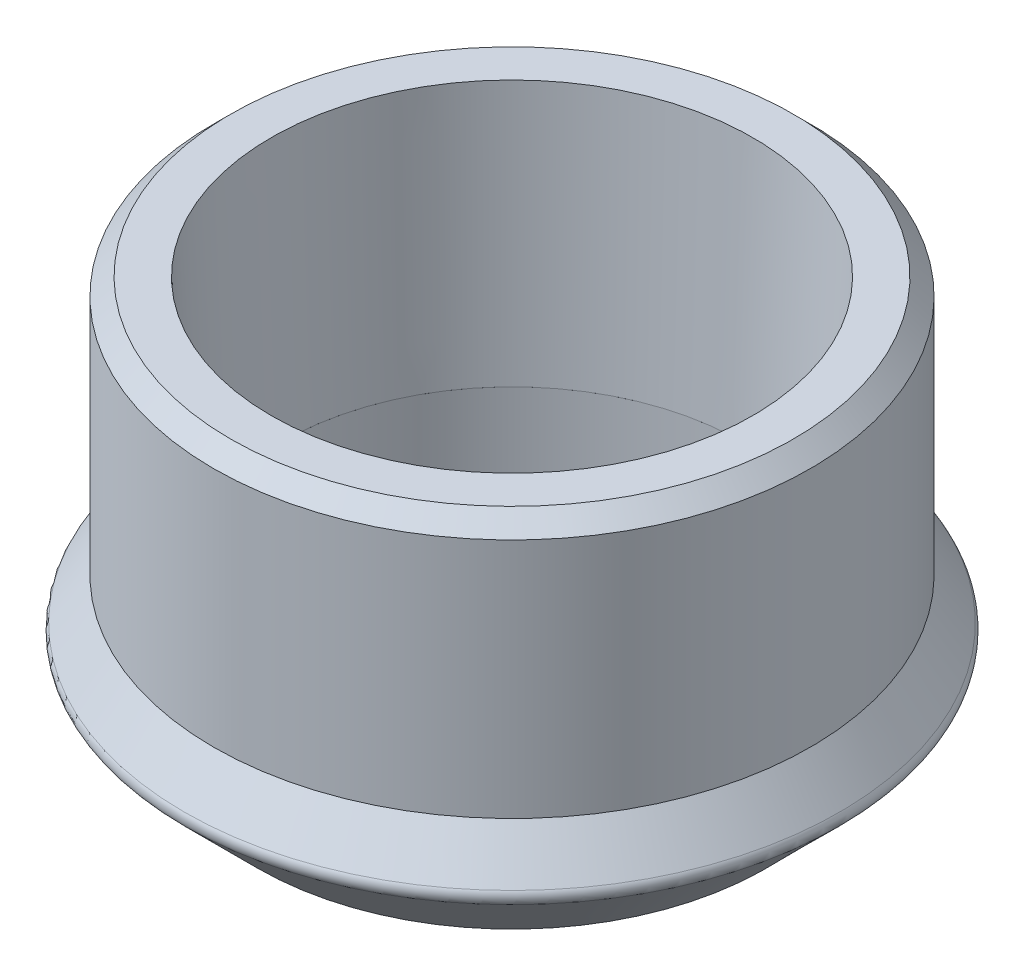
ISO-10303-21;
HEADER;
FILE_DESCRIPTION(('STEP AP214'),'2;1');
FILE_NAME('part.step','',(''),(''),'','','');
FILE_SCHEMA(('AUTOMOTIVE_DESIGN { 1 0 10303 214 1 1 1 1 }'));
ENDSEC;
DATA;
#1=APPLICATION_CONTEXT('core data for automotive mechanical design processes');
#2=APPLICATION_PROTOCOL_DEFINITION('international standard','automotive_design',2000,#1);
#3=PRODUCT_CONTEXT('',#1,'mechanical');
#4=PRODUCT('Part','Part','',(#3));
#5=PRODUCT_RELATED_PRODUCT_CATEGORY('part','',(#4));
#6=PRODUCT_DEFINITION_FORMATION('','',#4);
#7=PRODUCT_DEFINITION_CONTEXT('part definition',#1,'design');
#8=PRODUCT_DEFINITION('design','',#6,#7);
#9=PRODUCT_DEFINITION_SHAPE('','',#8);
#10=(LENGTH_UNIT() NAMED_UNIT(*) SI_UNIT(.MILLI.,.METRE.));
#11=(NAMED_UNIT(*) PLANE_ANGLE_UNIT() SI_UNIT($,.RADIAN.));
#12=(NAMED_UNIT(*) SI_UNIT($,.STERADIAN.) SOLID_ANGLE_UNIT());
#13=UNCERTAINTY_MEASURE_WITH_UNIT(LENGTH_MEASURE(1.E-05),#10,'distance_accuracy_value','');
#14=(GEOMETRIC_REPRESENTATION_CONTEXT(3) GLOBAL_UNCERTAINTY_ASSIGNED_CONTEXT((#13)) GLOBAL_UNIT_ASSIGNED_CONTEXT((#10,
#11,#12)) REPRESENTATION_CONTEXT('',''));
#15=CARTESIAN_POINT('',(0.,0.,0.));
#16=DIRECTION('',(0.,0.,1.));
#17=DIRECTION('',(1.,0.,0.));
#18=AXIS2_PLACEMENT_3D('',#15,#16,#17);
#19=CARTESIAN_POINT('',(0.,10.,0.));
#20=DIRECTION('',(0.,-1.,0.));
#21=DIRECTION('',(0.,0.,-1.));
#22=AXIS2_PLACEMENT_3D('',#19,#20,#21);
#23=CYLINDRICAL_SURFACE('',#22,8.75);
#24=CARTESIAN_POINT('',(0.,2.42814800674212,0.));
#25=DIRECTION('',(0.,1.,0.));
#26=DIRECTION('',(0.,0.,1.));
#27=AXIS2_PLACEMENT_3D('',#24,#25,#26);
#28=CIRCLE('',#27,8.75);
#29=CARTESIAN_POINT('',(0.,2.42814800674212,8.75));
#30=VERTEX_POINT('',#29);
#31=EDGE_CURVE('E73',#30,#30,#28,.T.);
#32=ORIENTED_EDGE('',*,*,#31,.T.);
#33=EDGE_LOOP('',(#32));
#34=FACE_BOUND('',#33,.T.);
#35=CARTESIAN_POINT('',(0.,9.50000000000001,0.));
#36=DIRECTION('',(0.,1.,0.));
#37=DIRECTION('',(0.,0.,1.));
#38=AXIS2_PLACEMENT_3D('',#35,#36,#37);
#39=CIRCLE('',#38,8.75);
#40=CARTESIAN_POINT('',(0.,9.50000000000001,8.75));
#41=VERTEX_POINT('',#40);
#42=EDGE_CURVE('E53',#41,#41,#39,.F.);
#43=ORIENTED_EDGE('',*,*,#42,.T.);
#44=EDGE_LOOP('',(#43));
#45=FACE_BOUND('',#44,.T.);
#46=ADVANCED_FACE('F38',(#34,#45),#23,.T.);
#47=CARTESIAN_POINT('',(0.,10.,0.));
#48=DIRECTION('',(0.,1.,0.));
#49=DIRECTION('',(0.,0.,1.));
#50=AXIS2_PLACEMENT_3D('',#47,#48,#49);
#51=PLANE('',#50);
#52=CARTESIAN_POINT('',(0.,10.,0.));
#53=DIRECTION('',(0.,1.,0.));
#54=DIRECTION('',(0.,0.,1.));
#55=AXIS2_PLACEMENT_3D('',#52,#53,#54);
#56=CIRCLE('',#55,8.25000000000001);
#57=CARTESIAN_POINT('',(0.,10.,8.25000000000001));
#58=VERTEX_POINT('',#57);
#59=EDGE_CURVE('E58',#58,#58,#56,.T.);
#60=ORIENTED_EDGE('',*,*,#59,.T.);
#61=EDGE_LOOP('',(#60));
#62=FACE_BOUND('',#61,.T.);
#63=CARTESIAN_POINT('',(0.,10.,0.));
#64=DIRECTION('',(0.,1.,0.));
#65=DIRECTION('',(0.,0.,1.));
#66=AXIS2_PLACEMENT_3D('',#63,#64,#65);
#67=CIRCLE('',#66,7.06);
#68=CARTESIAN_POINT('',(0.,10.,7.06));
#69=VERTEX_POINT('',#68);
#70=EDGE_CURVE('E61',#69,#69,#67,.F.);
#71=ORIENTED_EDGE('',*,*,#70,.T.);
#72=EDGE_LOOP('',(#71));
#73=FACE_BOUND('',#72,.T.);
#74=ADVANCED_FACE('F93',(#62,#73),#51,.T.);
#75=CARTESIAN_POINT('',(0.,2.4143764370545,0.));
#76=DIRECTION('',(0.,1.,0.));
#77=DIRECTION('',(0.,0.,1.));
#78=AXIS2_PLACEMENT_3D('',#75,#76,#77);
#79=CONICAL_SURFACE('',#78,6.75,0.0408440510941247);
#80=CARTESIAN_POINT('',(0.,2.42814800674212,0.));
#81=DIRECTION('',(0.,1.,0.));
#82=DIRECTION('',(0.,0.,1.));
#83=AXIS2_PLACEMENT_3D('',#80,#81,#82);
#84=CIRCLE('',#83,6.75056279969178);
#85=CARTESIAN_POINT('',(0.,2.42814800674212,6.75056279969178));
#86=VERTEX_POINT('',#85);
#87=EDGE_CURVE('E49',#86,#86,#84,.T.);
#88=ORIENTED_EDGE('',*,*,#87,.F.);
#89=EDGE_LOOP('',(#88));
#90=FACE_BOUND('',#89,.T.);
#91=ORIENTED_EDGE('',*,*,#70,.F.);
#92=EDGE_LOOP('',(#91));
#93=FACE_BOUND('',#92,.T.);
#94=ADVANCED_FACE('F98',(#90,#93),#79,.F.);
#95=CARTESIAN_POINT('',(0.,10.,0.));
#96=DIRECTION('',(0.,-1.,0.));
#97=DIRECTION('',(0.,0.,-1.));
#98=AXIS2_PLACEMENT_3D('',#95,#96,#97);
#99=CONICAL_SURFACE('',#98,8.25000000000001,0.785398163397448);
#100=ORIENTED_EDGE('',*,*,#42,.F.);
#101=EDGE_LOOP('',(#100));
#102=FACE_BOUND('',#101,.T.);
#103=ORIENTED_EDGE('',*,*,#59,.F.);
#104=EDGE_LOOP('',(#103));
#105=FACE_BOUND('',#104,.T.);
#106=ADVANCED_FACE('F113',(#102,#105),#99,.T.);
#107=CARTESIAN_POINT('',(0.,2.42814800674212,8.75));
#108=DIRECTION('',(0.,1.,0.));
#109=DIRECTION('',(0.,0.,1.));
#110=AXIS2_PLACEMENT_3D('',#107,#108,#109);
#111=PLANE('',#110);
#112=CARTESIAN_POINT('',(0.,2.42814800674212,0.));
#113=DIRECTION('',(0.,1.,0.));
#114=DIRECTION('',(0.,0.,1.));
#115=AXIS2_PLACEMENT_3D('',#112,#113,#114);
#116=CIRCLE('',#115,6.75);
#117=CARTESIAN_POINT('',(0.,2.42814800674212,6.75));
#118=VERTEX_POINT('',#117);
#119=EDGE_CURVE('E70',#118,#118,#116,.T.);
#120=ORIENTED_EDGE('',*,*,#119,.F.);
#121=EDGE_LOOP('',(#120));
#122=FACE_BOUND('',#121,.T.);
#123=ORIENTED_EDGE('',*,*,#87,.T.);
#124=EDGE_LOOP('',(#123));
#125=FACE_BOUND('',#124,.T.);
#126=ADVANCED_FACE('F106',(#122,#125),#111,.T.);
#127=CARTESIAN_POINT('',(0.,10.,0.));
#128=DIRECTION('',(0.,-1.,0.));
#129=DIRECTION('',(0.,0.,-1.));
#130=AXIS2_PLACEMENT_3D('',#127,#128,#129);
#131=CYLINDRICAL_SURFACE('',#130,6.75);
#132=ORIENTED_EDGE('',*,*,#119,.T.);
#133=EDGE_LOOP('',(#132));
#134=FACE_BOUND('',#133,.T.);
#135=CARTESIAN_POINT('',(0.,-1.29999999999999,0.));
#136=DIRECTION('',(0.,1.,0.));
#137=DIRECTION('',(0.,0.,1.));
#138=AXIS2_PLACEMENT_3D('',#135,#136,#137);
#139=CIRCLE('',#138,6.75);
#140=CARTESIAN_POINT('',(0.,-1.29999999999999,6.75));
#141=VERTEX_POINT('',#140);
#142=EDGE_CURVE('E67',#141,#141,#139,.T.);
#143=ORIENTED_EDGE('',*,*,#142,.F.);
#144=EDGE_LOOP('',(#143));
#145=FACE_BOUND('',#144,.T.);
#146=ADVANCED_FACE('F103',(#134,#145),#131,.F.);
#147=CARTESIAN_POINT('',(0.,1.,0.));
#148=DIRECTION('',(0.,1.,0.));
#149=DIRECTION('',(0.,0.,1.));
#150=AXIS2_PLACEMENT_3D('',#147,#148,#149);
#151=CONICAL_SURFACE('',#150,9.75,0.785398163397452);
#152=CARTESIAN_POINT('',(0.,0.822000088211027,0.));
#153=DIRECTION('',(0.,-1.,0.));
#154=DIRECTION('',(0.,0.,-1.));
#155=AXIS2_PLACEMENT_3D('',#152,#153,#154);
#156=CIRCLE('',#155,9.57200008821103);
#157=CARTESIAN_POINT('',(0.,0.822000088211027,-9.57200008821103));
#158=VERTEX_POINT('',#157);
#159=EDGE_CURVE('E10',#158,#158,#156,.T.);
#160=ORIENTED_EDGE('',*,*,#159,.T.);
#161=EDGE_LOOP('',(#160));
#162=FACE_BOUND('',#161,.T.);
#163=CARTESIAN_POINT('',(0.,-1.29999999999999,0.));
#164=DIRECTION('',(0.,1.,0.));
#165=DIRECTION('',(0.,0.,1.));
#166=AXIS2_PLACEMENT_3D('',#163,#164,#165);
#167=CIRCLE('',#166,7.45);
#168=CARTESIAN_POINT('',(0.,-1.29999999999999,7.45));
#169=VERTEX_POINT('',#168);
#170=EDGE_CURVE('E64',#169,#169,#167,.T.);
#171=ORIENTED_EDGE('',*,*,#170,.T.);
#172=EDGE_LOOP('',(#171));
#173=FACE_BOUND('',#172,.T.);
#174=ADVANCED_FACE('F88',(#162,#173),#151,.T.);
#175=CARTESIAN_POINT('',(0.,-1.29999999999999,7.45));
#176=DIRECTION('',(0.,-1.,0.));
#177=DIRECTION('',(0.,0.,-1.));
#178=AXIS2_PLACEMENT_3D('',#175,#176,#177);
#179=PLANE('',#178);
#180=ORIENTED_EDGE('',*,*,#142,.T.);
#181=EDGE_LOOP('',(#180));
#182=FACE_BOUND('',#181,.T.);
#183=ORIENTED_EDGE('',*,*,#170,.F.);
#184=EDGE_LOOP('',(#183));
#185=FACE_BOUND('',#184,.T.);
#186=ADVANCED_FACE('F81',(#182,#185),#179,.T.);
#187=CARTESIAN_POINT('',(0.,2.42814800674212,0.));
#188=DIRECTION('',(0.,-1.,0.));
#189=DIRECTION('',(0.,0.,-1.));
#190=AXIS2_PLACEMENT_3D('',#187,#188,#189);
#191=CONICAL_SURFACE('',#190,8.75,0.610865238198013);
#192=CARTESIAN_POINT('',(0.,1.2062050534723,0.));
#193=DIRECTION('',(0.,1.,0.));
#194=DIRECTION('',(0.,0.,1.));
#195=AXIS2_PLACEMENT_3D('',#192,#193,#194);
#196=CIRCLE('',#195,9.60561366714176);
#197=CARTESIAN_POINT('',(0.,1.2062050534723,9.60561366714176));
#198=VERTEX_POINT('',#197);
#199=EDGE_CURVE('E45',#198,#198,#196,.T.);
#200=ORIENTED_EDGE('',*,*,#199,.T.);
#201=EDGE_LOOP('',(#200));
#202=FACE_BOUND('',#201,.T.);
#203=ORIENTED_EDGE('',*,*,#31,.F.);
#204=EDGE_LOOP('',(#203));
#205=FACE_BOUND('',#204,.T.);
#206=ADVANCED_FACE('F79',(#202,#205),#191,.T.);
#207=CARTESIAN_POINT('',(0.,1.03413212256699,0.));
#208=DIRECTION('',(0.,-1.,0.));
#209=DIRECTION('',(0.,0.,-1.));
#210=AXIS2_PLACEMENT_3D('',#207,#208,#209);
#211=TOROIDAL_SURFACE('',#210,9.35986805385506,0.3);
#212=ORIENTED_EDGE('',*,*,#159,.F.);
#213=EDGE_LOOP('',(#212));
#214=FACE_BOUND('',#213,.T.);
#215=ORIENTED_EDGE('',*,*,#199,.F.);
#216=EDGE_LOOP('',(#215));
#217=FACE_BOUND('',#216,.T.);
#218=ADVANCED_FACE('F40',(#214,#217),#211,.T.);
#219=CLOSED_SHELL('',(#46,#74,#94,#106,#126,#146,#174,#186,#206,#218));
#220=MANIFOLD_SOLID_BREP('B2',#219);
#221=ADVANCED_BREP_SHAPE_REPRESENTATION('',(#18,#220),#14);
#222=SHAPE_DEFINITION_REPRESENTATION(#9,#221);
ENDSEC;
END-ISO-10303-21;
